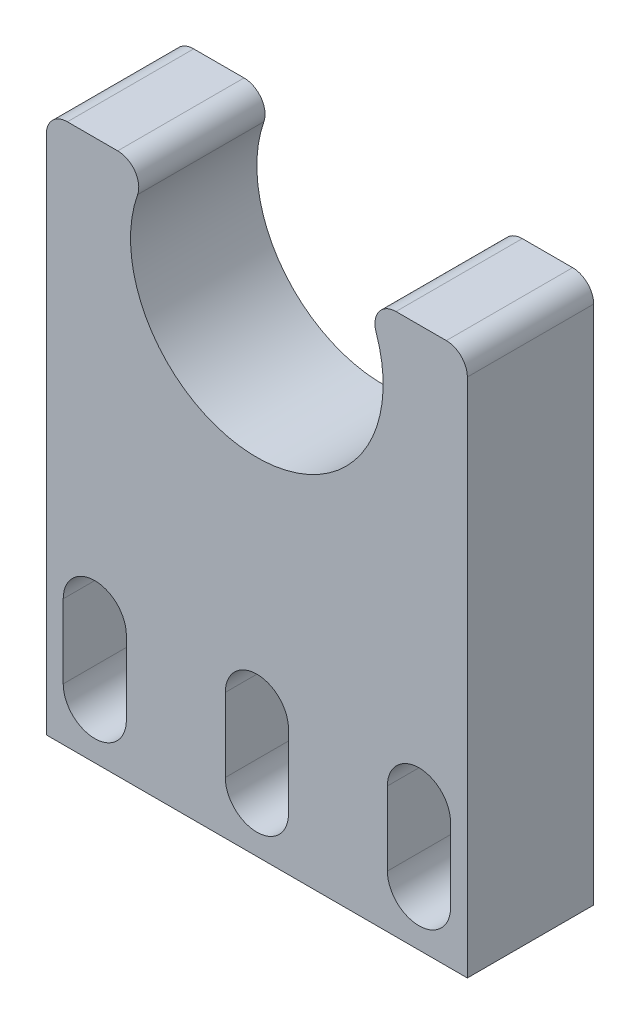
ISO-10303-21;
HEADER;
FILE_DESCRIPTION(('STEP AP214'),'2;1');
FILE_NAME('part.step','',(''),(''),'','','');
FILE_SCHEMA(('AUTOMOTIVE_DESIGN { 1 0 10303 214 1 1 1 1 }'));
ENDSEC;
DATA;
#1=APPLICATION_CONTEXT('core data for automotive mechanical design processes');
#2=APPLICATION_PROTOCOL_DEFINITION('international standard','automotive_design',2000,#1);
#3=PRODUCT_CONTEXT('',#1,'mechanical');
#4=PRODUCT('Part','Part','',(#3));
#5=PRODUCT_RELATED_PRODUCT_CATEGORY('part','',(#4));
#6=PRODUCT_DEFINITION_FORMATION('','',#4);
#7=PRODUCT_DEFINITION_CONTEXT('part definition',#1,'design');
#8=PRODUCT_DEFINITION('design','',#6,#7);
#9=PRODUCT_DEFINITION_SHAPE('','',#8);
#10=(LENGTH_UNIT() NAMED_UNIT(*) SI_UNIT(.MILLI.,.METRE.));
#11=(NAMED_UNIT(*) PLANE_ANGLE_UNIT() SI_UNIT($,.RADIAN.));
#12=(NAMED_UNIT(*) SI_UNIT($,.STERADIAN.) SOLID_ANGLE_UNIT());
#13=UNCERTAINTY_MEASURE_WITH_UNIT(LENGTH_MEASURE(1.E-05),#10,'distance_accuracy_value','');
#14=(GEOMETRIC_REPRESENTATION_CONTEXT(3) GLOBAL_UNCERTAINTY_ASSIGNED_CONTEXT((#13)) GLOBAL_UNIT_ASSIGNED_CONTEXT((#10,
#11,#12)) REPRESENTATION_CONTEXT('',''));
#15=CARTESIAN_POINT('',(0.,0.,0.));
#16=DIRECTION('',(0.,0.,1.));
#17=DIRECTION('',(1.,0.,0.));
#18=AXIS2_PLACEMENT_3D('',#15,#16,#17);
#19=CARTESIAN_POINT('',(-218.342156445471,37.4206206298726,6.));
#20=DIRECTION('',(0.,0.,1.));
#21=DIRECTION('',(1.,0.,0.));
#22=AXIS2_PLACEMENT_3D('',#19,#20,#21);
#23=PLANE('',#22);
#24=DIRECTION('',(0.,-1.,0.));
#25=VECTOR('',#24,1.);
#26=CARTESIAN_POINT('',(-228.840096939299,18.6985803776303,6.));
#27=LINE('',#26,#25);
#28=CARTESIAN_POINT('',(-228.840096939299,18.6985803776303,6.));
#29=VERTEX_POINT('',#28);
#30=CARTESIAN_POINT('',(-228.840096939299,15.1985803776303,6.));
#31=VERTEX_POINT('',#30);
#32=EDGE_CURVE('E217',#29,#31,#27,.T.);
#33=ORIENTED_EDGE('',*,*,#32,.F.);
#34=CARTESIAN_POINT('',(-227.340096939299,18.6985803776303,6.));
#35=DIRECTION('',(0.,0.,1.));
#36=DIRECTION('',(1.,0.,0.));
#37=AXIS2_PLACEMENT_3D('',#34,#35,#36);
#38=CIRCLE('',#37,1.5);
#39=CARTESIAN_POINT('',(-225.840096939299,18.6985803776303,6.));
#40=VERTEX_POINT('',#39);
#41=EDGE_CURVE('E215',#40,#29,#38,.T.);
#42=ORIENTED_EDGE('',*,*,#41,.F.);
#43=DIRECTION('',(0.,1.,0.));
#44=VECTOR('',#43,1.);
#45=CARTESIAN_POINT('',(-225.840096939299,18.6985803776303,6.));
#46=LINE('',#45,#44);
#47=CARTESIAN_POINT('',(-225.840096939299,15.1985803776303,6.));
#48=VERTEX_POINT('',#47);
#49=EDGE_CURVE('E223',#48,#40,#46,.T.);
#50=ORIENTED_EDGE('',*,*,#49,.F.);
#51=CARTESIAN_POINT('',(-227.340096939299,15.1985803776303,6.));
#52=DIRECTION('',(0.,0.,1.));
#53=DIRECTION('',(1.,0.,0.));
#54=AXIS2_PLACEMENT_3D('',#51,#52,#53);
#55=CIRCLE('',#54,1.5);
#56=EDGE_CURVE('E220',#31,#48,#55,.T.);
#57=ORIENTED_EDGE('',*,*,#56,.F.);
#58=EDGE_LOOP('',(#33,#42,#50,#57));
#59=FACE_BOUND('',#58,.T.);
#60=DIRECTION('',(1.,0.,0.));
#61=VECTOR('',#60,1.);
#62=CARTESIAN_POINT('',(-237.342156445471,12.6985803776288,6.));
#63=LINE('',#62,#61);
#64=CARTESIAN_POINT('',(-237.342156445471,12.6985803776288,6.));
#65=VERTEX_POINT('',#64);
#66=CARTESIAN_POINT('',(-217.342156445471,12.6985803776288,6.));
#67=VERTEX_POINT('',#66);
#68=EDGE_CURVE('E277',#65,#67,#63,.T.);
#69=ORIENTED_EDGE('',*,*,#68,.T.);
#70=DIRECTION('',(0.,1.,0.));
#71=VECTOR('',#70,1.);
#72=CARTESIAN_POINT('',(-217.342156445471,12.6985803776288,6.));
#73=LINE('',#72,#71);
#74=CARTESIAN_POINT('',(-217.342156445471,37.4206206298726,6.));
#75=VERTEX_POINT('',#74);
#76=EDGE_CURVE('E279',#67,#75,#73,.T.);
#77=ORIENTED_EDGE('',*,*,#76,.T.);
#78=CARTESIAN_POINT('',(-218.342156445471,37.4206206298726,6.));
#79=DIRECTION('',(0.,0.,1.));
#80=DIRECTION('',(1.,0.,0.));
#81=AXIS2_PLACEMENT_3D('',#78,#79,#80);
#82=CIRCLE('',#81,1.);
#83=CARTESIAN_POINT('',(-218.342156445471,38.4206206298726,6.));
#84=VERTEX_POINT('',#83);
#85=EDGE_CURVE('E282',#75,#84,#82,.T.);
#86=ORIENTED_EDGE('',*,*,#85,.T.);
#87=DIRECTION('',(-1.,0.,0.));
#88=VECTOR('',#87,1.);
#89=CARTESIAN_POINT('',(-220.733106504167,38.4206206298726,6.));
#90=LINE('',#89,#88);
#91=CARTESIAN_POINT('',(-220.733106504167,38.4206206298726,6.));
#92=VERTEX_POINT('',#91);
#93=EDGE_CURVE('E284',#84,#92,#90,.T.);
#94=ORIENTED_EDGE('',*,*,#93,.T.);
#95=CARTESIAN_POINT('',(-220.733106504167,37.4206206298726,6.));
#96=DIRECTION('',(0.,0.,1.));
#97=DIRECTION('',(1.,0.,0.));
#98=AXIS2_PLACEMENT_3D('',#95,#96,#97);
#99=CIRCLE('',#98,0.999999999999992);
#100=CARTESIAN_POINT('',(-221.677256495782,37.0911046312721,6.));
#101=VERTEX_POINT('',#100);
#102=EDGE_CURVE('E286',#92,#101,#99,.T.);
#103=ORIENTED_EDGE('',*,*,#102,.T.);
#104=CARTESIAN_POINT('',(-227.342156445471,35.114008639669,6.));
#105=DIRECTION('',(0.,0.,-1.));
#106=DIRECTION('',(1.,0.,0.));
#107=AXIS2_PLACEMENT_3D('',#104,#105,#106);
#108=CIRCLE('',#107,6.00000000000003);
#109=CARTESIAN_POINT('',(-233.00705639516,37.0911046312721,6.));
#110=VERTEX_POINT('',#109);
#111=EDGE_CURVE('E288',#101,#110,#108,.T.);
#112=ORIENTED_EDGE('',*,*,#111,.T.);
#113=CARTESIAN_POINT('',(-233.951206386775,37.4206206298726,6.));
#114=DIRECTION('',(0.,0.,1.));
#115=DIRECTION('',(1.,0.,0.));
#116=AXIS2_PLACEMENT_3D('',#113,#114,#115);
#117=CIRCLE('',#116,0.999999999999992);
#118=CARTESIAN_POINT('',(-233.951206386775,38.4206206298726,6.));
#119=VERTEX_POINT('',#118);
#120=EDGE_CURVE('E290',#110,#119,#117,.T.);
#121=ORIENTED_EDGE('',*,*,#120,.T.);
#122=DIRECTION('',(-1.,0.,0.));
#123=VECTOR('',#122,1.);
#124=CARTESIAN_POINT('',(-233.951206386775,38.4206206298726,6.));
#125=LINE('',#124,#123);
#126=CARTESIAN_POINT('',(-236.342156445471,38.4206206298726,6.));
#127=VERTEX_POINT('',#126);
#128=EDGE_CURVE('E292',#119,#127,#125,.T.);
#129=ORIENTED_EDGE('',*,*,#128,.T.);
#130=CARTESIAN_POINT('',(-236.342156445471,37.4206206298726,6.));
#131=DIRECTION('',(0.,0.,1.));
#132=DIRECTION('',(-1.,0.,0.));
#133=AXIS2_PLACEMENT_3D('',#130,#131,#132);
#134=CIRCLE('',#133,1.);
#135=CARTESIAN_POINT('',(-237.342156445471,37.4206206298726,6.));
#136=VERTEX_POINT('',#135);
#137=EDGE_CURVE('E294',#127,#136,#134,.T.);
#138=ORIENTED_EDGE('',*,*,#137,.T.);
#139=DIRECTION('',(0.,-1.,0.));
#140=VECTOR('',#139,1.);
#141=CARTESIAN_POINT('',(-237.342156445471,37.4206206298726,6.));
#142=LINE('',#141,#140);
#143=EDGE_CURVE('E296',#136,#65,#142,.T.);
#144=ORIENTED_EDGE('',*,*,#143,.T.);
#145=EDGE_LOOP('',(#69,#77,#86,#94,#103,#112,#121,#129,#138,#144));
#146=FACE_BOUND('',#145,.T.);
#147=DIRECTION('',(0.,-1.,0.));
#148=VECTOR('',#147,1.);
#149=CARTESIAN_POINT('',(-236.540096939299,18.6985803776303,6.));
#150=LINE('',#149,#148);
#151=CARTESIAN_POINT('',(-236.540096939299,18.6985803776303,6.));
#152=VERTEX_POINT('',#151);
#153=CARTESIAN_POINT('',(-236.540096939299,15.1985803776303,6.));
#154=VERTEX_POINT('',#153);
#155=EDGE_CURVE('E248',#152,#154,#150,.T.);
#156=ORIENTED_EDGE('',*,*,#155,.F.);
#157=CARTESIAN_POINT('',(-235.040096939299,18.6985803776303,6.));
#158=DIRECTION('',(0.,0.,1.));
#159=DIRECTION('',(1.,0.,0.));
#160=AXIS2_PLACEMENT_3D('',#157,#158,#159);
#161=CIRCLE('',#160,1.5);
#162=CARTESIAN_POINT('',(-233.540096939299,18.6985803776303,6.));
#163=VERTEX_POINT('',#162);
#164=EDGE_CURVE('E246',#163,#152,#161,.T.);
#165=ORIENTED_EDGE('',*,*,#164,.F.);
#166=DIRECTION('',(0.,1.,0.));
#167=VECTOR('',#166,1.);
#168=CARTESIAN_POINT('',(-233.540096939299,18.6985803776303,6.));
#169=LINE('',#168,#167);
#170=CARTESIAN_POINT('',(-233.540096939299,15.1985803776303,6.));
#171=VERTEX_POINT('',#170);
#172=EDGE_CURVE('E254',#171,#163,#169,.T.);
#173=ORIENTED_EDGE('',*,*,#172,.F.);
#174=CARTESIAN_POINT('',(-235.040096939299,15.1985803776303,6.));
#175=DIRECTION('',(0.,0.,1.));
#176=DIRECTION('',(1.,0.,0.));
#177=AXIS2_PLACEMENT_3D('',#174,#175,#176);
#178=CIRCLE('',#177,1.5);
#179=EDGE_CURVE('E251',#154,#171,#178,.T.);
#180=ORIENTED_EDGE('',*,*,#179,.F.);
#181=EDGE_LOOP('',(#156,#165,#173,#180));
#182=FACE_BOUND('',#181,.T.);
#183=DIRECTION('',(0.,-1.,0.));
#184=VECTOR('',#183,1.);
#185=CARTESIAN_POINT('',(-221.140096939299,18.6985803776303,6.));
#186=LINE('',#185,#184);
#187=CARTESIAN_POINT('',(-221.140096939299,18.6985803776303,6.));
#188=VERTEX_POINT('',#187);
#189=CARTESIAN_POINT('',(-221.140096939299,15.1985803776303,6.));
#190=VERTEX_POINT('',#189);
#191=EDGE_CURVE('E187',#188,#190,#186,.T.);
#192=ORIENTED_EDGE('',*,*,#191,.F.);
#193=CARTESIAN_POINT('',(-219.640096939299,18.6985803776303,6.));
#194=DIRECTION('',(0.,0.,1.));
#195=DIRECTION('',(1.,0.,0.));
#196=AXIS2_PLACEMENT_3D('',#193,#194,#195);
#197=CIRCLE('',#196,1.5);
#198=CARTESIAN_POINT('',(-218.140096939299,18.6985803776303,6.));
#199=VERTEX_POINT('',#198);
#200=EDGE_CURVE('E179',#199,#188,#197,.T.);
#201=ORIENTED_EDGE('',*,*,#200,.F.);
#202=DIRECTION('',(0.,1.,0.));
#203=VECTOR('',#202,1.);
#204=CARTESIAN_POINT('',(-218.140096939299,18.6985803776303,6.));
#205=LINE('',#204,#203);
#206=CARTESIAN_POINT('',(-218.140096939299,15.1985803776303,6.));
#207=VERTEX_POINT('',#206);
#208=EDGE_CURVE('E201',#207,#199,#205,.T.);
#209=ORIENTED_EDGE('',*,*,#208,.F.);
#210=CARTESIAN_POINT('',(-219.640096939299,15.1985803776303,6.));
#211=DIRECTION('',(0.,0.,1.));
#212=DIRECTION('',(1.,0.,0.));
#213=AXIS2_PLACEMENT_3D('',#210,#211,#212);
#214=CIRCLE('',#213,1.5);
#215=EDGE_CURVE('E199',#190,#207,#214,.T.);
#216=ORIENTED_EDGE('',*,*,#215,.F.);
#217=EDGE_LOOP('',(#192,#201,#209,#216));
#218=FACE_BOUND('',#217,.T.);
#219=ADVANCED_FACE('F30',(#59,#146,#182,#218),#23,.T.);
#220=CARTESIAN_POINT('',(-218.342156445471,37.4206206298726,0.));
#221=DIRECTION('',(0.,0.,1.));
#222=DIRECTION('',(1.,0.,0.));
#223=AXIS2_PLACEMENT_3D('',#220,#221,#222);
#224=PLANE('',#223);
#225=CARTESIAN_POINT('',(-227.340096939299,18.6985803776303,0.));
#226=DIRECTION('',(0.,0.,1.));
#227=DIRECTION('',(1.,0.,0.));
#228=AXIS2_PLACEMENT_3D('',#225,#226,#227);
#229=CIRCLE('',#228,1.5);
#230=CARTESIAN_POINT('',(-225.840096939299,18.6985803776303,0.));
#231=VERTEX_POINT('',#230);
#232=CARTESIAN_POINT('',(-228.840096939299,18.6985803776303,0.));
#233=VERTEX_POINT('',#232);
#234=EDGE_CURVE('E195',#231,#233,#229,.T.);
#235=ORIENTED_EDGE('',*,*,#234,.T.);
#236=DIRECTION('',(0.,-1.,0.));
#237=VECTOR('',#236,1.);
#238=CARTESIAN_POINT('',(-228.840096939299,18.6985803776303,0.));
#239=LINE('',#238,#237);
#240=CARTESIAN_POINT('',(-228.840096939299,15.1985803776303,0.));
#241=VERTEX_POINT('',#240);
#242=EDGE_CURVE('E228',#233,#241,#239,.T.);
#243=ORIENTED_EDGE('',*,*,#242,.T.);
#244=CARTESIAN_POINT('',(-227.340096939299,15.1985803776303,0.));
#245=DIRECTION('',(0.,0.,1.));
#246=DIRECTION('',(1.,0.,0.));
#247=AXIS2_PLACEMENT_3D('',#244,#245,#246);
#248=CIRCLE('',#247,1.5);
#249=CARTESIAN_POINT('',(-225.840096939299,15.1985803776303,0.));
#250=VERTEX_POINT('',#249);
#251=EDGE_CURVE('E231',#241,#250,#248,.T.);
#252=ORIENTED_EDGE('',*,*,#251,.T.);
#253=DIRECTION('',(0.,1.,0.));
#254=VECTOR('',#253,1.);
#255=CARTESIAN_POINT('',(-225.840096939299,18.6985803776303,0.));
#256=LINE('',#255,#254);
#257=EDGE_CURVE('E218',#250,#231,#256,.T.);
#258=ORIENTED_EDGE('',*,*,#257,.T.);
#259=EDGE_LOOP('',(#235,#243,#252,#258));
#260=FACE_BOUND('',#259,.T.);
#261=DIRECTION('',(1.,0.,0.));
#262=VECTOR('',#261,1.);
#263=CARTESIAN_POINT('',(-227.342156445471,12.6985803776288,0.));
#264=LINE('',#263,#262);
#265=CARTESIAN_POINT('',(-237.342156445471,12.6985803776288,0.));
#266=VERTEX_POINT('',#265);
#267=CARTESIAN_POINT('',(-217.342156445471,12.6985803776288,0.));
#268=VERTEX_POINT('',#267);
#269=EDGE_CURVE('E276',#266,#268,#264,.T.);
#270=ORIENTED_EDGE('',*,*,#269,.F.);
#271=DIRECTION('',(0.,-1.,0.));
#272=VECTOR('',#271,1.);
#273=CARTESIAN_POINT('',(-237.342156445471,12.6985803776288,0.));
#274=LINE('',#273,#272);
#275=CARTESIAN_POINT('',(-237.342156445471,37.4206206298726,0.));
#276=VERTEX_POINT('',#275);
#277=EDGE_CURVE('E280',#276,#266,#274,.T.);
#278=ORIENTED_EDGE('',*,*,#277,.F.);
#279=CARTESIAN_POINT('',(-236.342156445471,37.4206206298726,0.));
#280=DIRECTION('',(0.,0.,1.));
#281=DIRECTION('',(-1.,0.,0.));
#282=AXIS2_PLACEMENT_3D('',#279,#280,#281);
#283=CIRCLE('',#282,1.);
#284=CARTESIAN_POINT('',(-236.342156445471,38.4206206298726,0.));
#285=VERTEX_POINT('',#284);
#286=EDGE_CURVE('E315',#285,#276,#283,.T.);
#287=ORIENTED_EDGE('',*,*,#286,.F.);
#288=DIRECTION('',(-1.,0.,0.));
#289=VECTOR('',#288,1.);
#290=CARTESIAN_POINT('',(-233.951206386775,38.4206206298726,0.));
#291=LINE('',#290,#289);
#292=CARTESIAN_POINT('',(-233.951206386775,38.4206206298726,0.));
#293=VERTEX_POINT('',#292);
#294=EDGE_CURVE('E313',#293,#285,#291,.T.);
#295=ORIENTED_EDGE('',*,*,#294,.F.);
#296=CARTESIAN_POINT('',(-233.951206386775,37.4206206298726,0.));
#297=DIRECTION('',(0.,0.,1.));
#298=DIRECTION('',(1.,0.,0.));
#299=AXIS2_PLACEMENT_3D('',#296,#297,#298);
#300=CIRCLE('',#299,0.999999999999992);
#301=CARTESIAN_POINT('',(-233.00705639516,37.0911046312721,0.));
#302=VERTEX_POINT('',#301);
#303=EDGE_CURVE('E311',#302,#293,#300,.T.);
#304=ORIENTED_EDGE('',*,*,#303,.F.);
#305=CARTESIAN_POINT('',(-227.342156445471,35.114008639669,0.));
#306=DIRECTION('',(0.,0.,-1.));
#307=DIRECTION('',(1.,0.,0.));
#308=AXIS2_PLACEMENT_3D('',#305,#306,#307);
#309=CIRCLE('',#308,6.00000000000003);
#310=CARTESIAN_POINT('',(-221.677256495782,37.0911046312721,0.));
#311=VERTEX_POINT('',#310);
#312=EDGE_CURVE('E309',#311,#302,#309,.T.);
#313=ORIENTED_EDGE('',*,*,#312,.F.);
#314=CARTESIAN_POINT('',(-220.733106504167,37.4206206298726,0.));
#315=DIRECTION('',(0.,0.,1.));
#316=DIRECTION('',(1.,0.,0.));
#317=AXIS2_PLACEMENT_3D('',#314,#315,#316);
#318=CIRCLE('',#317,0.999999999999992);
#319=CARTESIAN_POINT('',(-220.733106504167,38.4206206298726,0.));
#320=VERTEX_POINT('',#319);
#321=EDGE_CURVE('E307',#320,#311,#318,.T.);
#322=ORIENTED_EDGE('',*,*,#321,.F.);
#323=DIRECTION('',(-1.,0.,0.));
#324=VECTOR('',#323,1.);
#325=CARTESIAN_POINT('',(-220.733106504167,38.4206206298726,0.));
#326=LINE('',#325,#324);
#327=CARTESIAN_POINT('',(-218.342156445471,38.4206206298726,0.));
#328=VERTEX_POINT('',#327);
#329=EDGE_CURVE('E305',#328,#320,#326,.T.);
#330=ORIENTED_EDGE('',*,*,#329,.F.);
#331=CARTESIAN_POINT('',(-218.342156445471,37.4206206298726,0.));
#332=DIRECTION('',(0.,0.,1.));
#333=DIRECTION('',(1.,0.,0.));
#334=AXIS2_PLACEMENT_3D('',#331,#332,#333);
#335=CIRCLE('',#334,1.);
#336=CARTESIAN_POINT('',(-217.342156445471,37.4206206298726,0.));
#337=VERTEX_POINT('',#336);
#338=EDGE_CURVE('E303',#337,#328,#335,.T.);
#339=ORIENTED_EDGE('',*,*,#338,.F.);
#340=DIRECTION('',(0.,1.,0.));
#341=VECTOR('',#340,1.);
#342=CARTESIAN_POINT('',(-217.342156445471,37.4206206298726,0.));
#343=LINE('',#342,#341);
#344=EDGE_CURVE('E301',#268,#337,#343,.T.);
#345=ORIENTED_EDGE('',*,*,#344,.F.);
#346=EDGE_LOOP('',(#270,#278,#287,#295,#304,#313,#322,#330,#339,#345));
#347=FACE_BOUND('',#346,.T.);
#348=CARTESIAN_POINT('',(-235.040096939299,18.6985803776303,0.));
#349=DIRECTION('',(0.,0.,1.));
#350=DIRECTION('',(1.,0.,0.));
#351=AXIS2_PLACEMENT_3D('',#348,#349,#350);
#352=CIRCLE('',#351,1.5);
#353=CARTESIAN_POINT('',(-233.540096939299,18.6985803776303,0.));
#354=VERTEX_POINT('',#353);
#355=CARTESIAN_POINT('',(-236.540096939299,18.6985803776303,0.));
#356=VERTEX_POINT('',#355);
#357=EDGE_CURVE('E245',#354,#356,#352,.T.);
#358=ORIENTED_EDGE('',*,*,#357,.T.);
#359=DIRECTION('',(0.,-1.,0.));
#360=VECTOR('',#359,1.);
#361=CARTESIAN_POINT('',(-236.540096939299,18.6985803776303,0.));
#362=LINE('',#361,#360);
#363=CARTESIAN_POINT('',(-236.540096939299,15.1985803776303,0.));
#364=VERTEX_POINT('',#363);
#365=EDGE_CURVE('E259',#356,#364,#362,.T.);
#366=ORIENTED_EDGE('',*,*,#365,.T.);
#367=CARTESIAN_POINT('',(-235.040096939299,15.1985803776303,0.));
#368=DIRECTION('',(0.,0.,1.));
#369=DIRECTION('',(1.,0.,0.));
#370=AXIS2_PLACEMENT_3D('',#367,#368,#369);
#371=CIRCLE('',#370,1.5);
#372=CARTESIAN_POINT('',(-233.540096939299,15.1985803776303,0.));
#373=VERTEX_POINT('',#372);
#374=EDGE_CURVE('E262',#364,#373,#371,.T.);
#375=ORIENTED_EDGE('',*,*,#374,.T.);
#376=DIRECTION('',(0.,1.,0.));
#377=VECTOR('',#376,1.);
#378=CARTESIAN_POINT('',(-233.540096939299,18.6985803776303,0.));
#379=LINE('',#378,#377);
#380=EDGE_CURVE('E249',#373,#354,#379,.T.);
#381=ORIENTED_EDGE('',*,*,#380,.T.);
#382=EDGE_LOOP('',(#358,#366,#375,#381));
#383=FACE_BOUND('',#382,.T.);
#384=CARTESIAN_POINT('',(-219.640096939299,18.6985803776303,0.));
#385=DIRECTION('',(0.,0.,1.));
#386=DIRECTION('',(1.,0.,0.));
#387=AXIS2_PLACEMENT_3D('',#384,#385,#386);
#388=CIRCLE('',#387,1.5);
#389=CARTESIAN_POINT('',(-218.140096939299,18.6985803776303,0.));
#390=VERTEX_POINT('',#389);
#391=CARTESIAN_POINT('',(-221.140096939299,18.6985803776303,0.));
#392=VERTEX_POINT('',#391);
#393=EDGE_CURVE('E53',#390,#392,#388,.T.);
#394=ORIENTED_EDGE('',*,*,#393,.T.);
#395=DIRECTION('',(0.,-1.,0.));
#396=VECTOR('',#395,1.);
#397=CARTESIAN_POINT('',(-221.140096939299,18.6985803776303,0.));
#398=LINE('',#397,#396);
#399=CARTESIAN_POINT('',(-221.140096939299,15.1985803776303,0.));
#400=VERTEX_POINT('',#399);
#401=EDGE_CURVE('E194',#392,#400,#398,.T.);
#402=ORIENTED_EDGE('',*,*,#401,.T.);
#403=CARTESIAN_POINT('',(-219.640096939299,15.1985803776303,0.));
#404=DIRECTION('',(0.,0.,1.));
#405=DIRECTION('',(1.,0.,0.));
#406=AXIS2_PLACEMENT_3D('',#403,#404,#405);
#407=CIRCLE('',#406,1.5);
#408=CARTESIAN_POINT('',(-218.140096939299,15.1985803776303,0.));
#409=VERTEX_POINT('',#408);
#410=EDGE_CURVE('E207',#400,#409,#407,.T.);
#411=ORIENTED_EDGE('',*,*,#410,.T.);
#412=DIRECTION('',(0.,1.,0.));
#413=VECTOR('',#412,1.);
#414=CARTESIAN_POINT('',(-218.140096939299,18.6985803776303,0.));
#415=LINE('',#414,#413);
#416=EDGE_CURVE('E188',#409,#390,#415,.T.);
#417=ORIENTED_EDGE('',*,*,#416,.T.);
#418=EDGE_LOOP('',(#394,#402,#411,#417));
#419=FACE_BOUND('',#418,.T.);
#420=ADVANCED_FACE('F353',(#260,#347,#383,#419),#224,.F.);
#421=CARTESIAN_POINT('',(-227.342156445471,12.6985803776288,6.));
#422=DIRECTION('',(0.,1.,0.));
#423=DIRECTION('',(-1.,0.,0.));
#424=AXIS2_PLACEMENT_3D('',#421,#422,#423);
#425=PLANE('',#424);
#426=ORIENTED_EDGE('',*,*,#269,.T.);
#427=DIRECTION('',(0.,0.,-1.));
#428=VECTOR('',#427,1.);
#429=CARTESIAN_POINT('',(-217.342156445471,12.6985803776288,6.));
#430=LINE('',#429,#428);
#431=EDGE_CURVE('E11',#67,#268,#430,.T.);
#432=ORIENTED_EDGE('',*,*,#431,.F.);
#433=ORIENTED_EDGE('',*,*,#68,.F.);
#434=DIRECTION('',(0.,0.,-1.));
#435=VECTOR('',#434,1.);
#436=CARTESIAN_POINT('',(-237.342156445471,12.6985803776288,6.));
#437=LINE('',#436,#435);
#438=EDGE_CURVE('E298',#65,#266,#437,.T.);
#439=ORIENTED_EDGE('',*,*,#438,.T.);
#440=EDGE_LOOP('',(#426,#432,#433,#439));
#441=FACE_BOUND('',#440,.T.);
#442=ADVANCED_FACE('F32',(#441),#425,.F.);
#443=CARTESIAN_POINT('',(-217.342156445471,37.4206206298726,6.));
#444=DIRECTION('',(-1.,0.,0.));
#445=DIRECTION('',(0.,-1.,0.));
#446=AXIS2_PLACEMENT_3D('',#443,#444,#445);
#447=PLANE('',#446);
#448=ORIENTED_EDGE('',*,*,#344,.T.);
#449=DIRECTION('',(0.,0.,-1.));
#450=VECTOR('',#449,1.);
#451=CARTESIAN_POINT('',(-217.342156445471,37.4206206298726,6.));
#452=LINE('',#451,#450);
#453=EDGE_CURVE('E38',#75,#337,#452,.T.);
#454=ORIENTED_EDGE('',*,*,#453,.F.);
#455=ORIENTED_EDGE('',*,*,#76,.F.);
#456=ORIENTED_EDGE('',*,*,#431,.T.);
#457=EDGE_LOOP('',(#448,#454,#455,#456));
#458=FACE_BOUND('',#457,.T.);
#459=ADVANCED_FACE('F371',(#458),#447,.F.);
#460=CARTESIAN_POINT('',(-218.342156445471,37.4206206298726,6.));
#461=DIRECTION('',(0.,0.,-1.));
#462=DIRECTION('',(-1.,0.,0.));
#463=AXIS2_PLACEMENT_3D('',#460,#461,#462);
#464=CYLINDRICAL_SURFACE('',#463,1.);
#465=ORIENTED_EDGE('',*,*,#338,.T.);
#466=DIRECTION('',(0.,0.,-1.));
#467=VECTOR('',#466,1.);
#468=CARTESIAN_POINT('',(-218.342156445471,38.4206206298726,6.));
#469=LINE('',#468,#467);
#470=EDGE_CURVE('E340',#84,#328,#469,.T.);
#471=ORIENTED_EDGE('',*,*,#470,.F.);
#472=ORIENTED_EDGE('',*,*,#85,.F.);
#473=ORIENTED_EDGE('',*,*,#453,.T.);
#474=EDGE_LOOP('',(#465,#471,#472,#473));
#475=FACE_BOUND('',#474,.T.);
#476=ADVANCED_FACE('F347',(#475),#464,.T.);
#477=CARTESIAN_POINT('',(-220.733106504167,38.4206206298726,6.));
#478=DIRECTION('',(0.,-1.,0.));
#479=DIRECTION('',(0.,0.,-1.));
#480=AXIS2_PLACEMENT_3D('',#477,#478,#479);
#481=PLANE('',#480);
#482=ORIENTED_EDGE('',*,*,#329,.T.);
#483=DIRECTION('',(0.,0.,-1.));
#484=VECTOR('',#483,1.);
#485=CARTESIAN_POINT('',(-220.733106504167,38.4206206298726,6.));
#486=LINE('',#485,#484);
#487=EDGE_CURVE('E337',#92,#320,#486,.T.);
#488=ORIENTED_EDGE('',*,*,#487,.F.);
#489=ORIENTED_EDGE('',*,*,#93,.F.);
#490=ORIENTED_EDGE('',*,*,#470,.T.);
#491=EDGE_LOOP('',(#482,#488,#489,#490));
#492=FACE_BOUND('',#491,.T.);
#493=ADVANCED_FACE('F359',(#492),#481,.F.);
#494=CARTESIAN_POINT('',(-220.733106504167,37.4206206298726,6.));
#495=DIRECTION('',(0.,0.,-1.));
#496=DIRECTION('',(-1.,0.,0.));
#497=AXIS2_PLACEMENT_3D('',#494,#495,#496);
#498=CYLINDRICAL_SURFACE('',#497,0.999999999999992);
#499=ORIENTED_EDGE('',*,*,#321,.T.);
#500=DIRECTION('',(0.,0.,-1.));
#501=VECTOR('',#500,1.);
#502=CARTESIAN_POINT('',(-221.677256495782,37.0911046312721,6.));
#503=LINE('',#502,#501);
#504=EDGE_CURVE('E334',#101,#311,#503,.T.);
#505=ORIENTED_EDGE('',*,*,#504,.F.);
#506=ORIENTED_EDGE('',*,*,#102,.F.);
#507=ORIENTED_EDGE('',*,*,#487,.T.);
#508=EDGE_LOOP('',(#499,#505,#506,#507));
#509=FACE_BOUND('',#508,.T.);
#510=ADVANCED_FACE('F363',(#509),#498,.T.);
#511=CARTESIAN_POINT('',(-227.342156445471,35.114008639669,6.));
#512=DIRECTION('',(0.,0.,-1.));
#513=DIRECTION('',(-1.,0.,0.));
#514=AXIS2_PLACEMENT_3D('',#511,#512,#513);
#515=CYLINDRICAL_SURFACE('',#514,6.00000000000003);
#516=ORIENTED_EDGE('',*,*,#312,.T.);
#517=DIRECTION('',(0.,0.,-1.));
#518=VECTOR('',#517,1.);
#519=CARTESIAN_POINT('',(-233.00705639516,37.0911046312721,6.));
#520=LINE('',#519,#518);
#521=EDGE_CURVE('E331',#110,#302,#520,.T.);
#522=ORIENTED_EDGE('',*,*,#521,.F.);
#523=ORIENTED_EDGE('',*,*,#111,.F.);
#524=ORIENTED_EDGE('',*,*,#504,.T.);
#525=EDGE_LOOP('',(#516,#522,#523,#524));
#526=FACE_BOUND('',#525,.T.);
#527=ADVANCED_FACE('F393',(#526),#515,.F.);
#528=CARTESIAN_POINT('',(-233.951206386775,37.4206206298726,6.));
#529=DIRECTION('',(0.,0.,-1.));
#530=DIRECTION('',(-1.,0.,0.));
#531=AXIS2_PLACEMENT_3D('',#528,#529,#530);
#532=CYLINDRICAL_SURFACE('',#531,0.999999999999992);
#533=ORIENTED_EDGE('',*,*,#303,.T.);
#534=DIRECTION('',(0.,0.,-1.));
#535=VECTOR('',#534,1.);
#536=CARTESIAN_POINT('',(-233.951206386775,38.4206206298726,6.));
#537=LINE('',#536,#535);
#538=EDGE_CURVE('E328',#119,#293,#537,.T.);
#539=ORIENTED_EDGE('',*,*,#538,.F.);
#540=ORIENTED_EDGE('',*,*,#120,.F.);
#541=ORIENTED_EDGE('',*,*,#521,.T.);
#542=EDGE_LOOP('',(#533,#539,#540,#541));
#543=FACE_BOUND('',#542,.T.);
#544=ADVANCED_FACE('F391',(#543),#532,.T.);
#545=CARTESIAN_POINT('',(-233.951206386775,38.4206206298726,6.));
#546=DIRECTION('',(0.,-1.,0.));
#547=DIRECTION('',(0.,0.,-1.));
#548=AXIS2_PLACEMENT_3D('',#545,#546,#547);
#549=PLANE('',#548);
#550=ORIENTED_EDGE('',*,*,#294,.T.);
#551=DIRECTION('',(0.,0.,-1.));
#552=VECTOR('',#551,1.);
#553=CARTESIAN_POINT('',(-236.342156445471,38.4206206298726,6.));
#554=LINE('',#553,#552);
#555=EDGE_CURVE('E325',#127,#285,#554,.T.);
#556=ORIENTED_EDGE('',*,*,#555,.F.);
#557=ORIENTED_EDGE('',*,*,#128,.F.);
#558=ORIENTED_EDGE('',*,*,#538,.T.);
#559=EDGE_LOOP('',(#550,#556,#557,#558));
#560=FACE_BOUND('',#559,.T.);
#561=ADVANCED_FACE('F386',(#560),#549,.F.);
#562=CARTESIAN_POINT('',(-236.342156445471,37.4206206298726,6.));
#563=DIRECTION('',(0.,0.,-1.));
#564=DIRECTION('',(-1.,0.,0.));
#565=AXIS2_PLACEMENT_3D('',#562,#563,#564);
#566=CYLINDRICAL_SURFACE('',#565,1.);
#567=ORIENTED_EDGE('',*,*,#286,.T.);
#568=DIRECTION('',(0.,0.,-1.));
#569=VECTOR('',#568,1.);
#570=CARTESIAN_POINT('',(-237.342156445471,37.4206206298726,6.));
#571=LINE('',#570,#569);
#572=EDGE_CURVE('E322',#136,#276,#571,.T.);
#573=ORIENTED_EDGE('',*,*,#572,.F.);
#574=ORIENTED_EDGE('',*,*,#137,.F.);
#575=ORIENTED_EDGE('',*,*,#555,.T.);
#576=EDGE_LOOP('',(#567,#573,#574,#575));
#577=FACE_BOUND('',#576,.T.);
#578=ADVANCED_FACE('F381',(#577),#566,.T.);
#579=CARTESIAN_POINT('',(-237.342156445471,12.6985803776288,6.));
#580=DIRECTION('',(1.,0.,0.));
#581=DIRECTION('',(0.,1.,0.));
#582=AXIS2_PLACEMENT_3D('',#579,#580,#581);
#583=PLANE('',#582);
#584=ORIENTED_EDGE('',*,*,#277,.T.);
#585=ORIENTED_EDGE('',*,*,#438,.F.);
#586=ORIENTED_EDGE('',*,*,#143,.F.);
#587=ORIENTED_EDGE('',*,*,#572,.T.);
#588=EDGE_LOOP('',(#584,#585,#586,#587));
#589=FACE_BOUND('',#588,.T.);
#590=ADVANCED_FACE('F376',(#589),#583,.F.);
#591=CARTESIAN_POINT('',(-235.040096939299,18.6985803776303,6.));
#592=DIRECTION('',(0.,0.,-1.));
#593=DIRECTION('',(-1.,0.,0.));
#594=AXIS2_PLACEMENT_3D('',#591,#592,#593);
#595=CYLINDRICAL_SURFACE('',#594,1.5);
#596=ORIENTED_EDGE('',*,*,#357,.F.);
#597=DIRECTION('',(0.,0.,-1.));
#598=VECTOR('',#597,1.);
#599=CARTESIAN_POINT('',(-233.540096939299,18.6985803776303,6.));
#600=LINE('',#599,#598);
#601=EDGE_CURVE('E256',#163,#354,#600,.T.);
#602=ORIENTED_EDGE('',*,*,#601,.F.);
#603=ORIENTED_EDGE('',*,*,#164,.T.);
#604=DIRECTION('',(0.,0.,-1.));
#605=VECTOR('',#604,1.);
#606=CARTESIAN_POINT('',(-236.540096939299,18.6985803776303,6.));
#607=LINE('',#606,#605);
#608=EDGE_CURVE('E273',#152,#356,#607,.T.);
#609=ORIENTED_EDGE('',*,*,#608,.T.);
#610=EDGE_LOOP('',(#596,#602,#603,#609));
#611=FACE_BOUND('',#610,.T.);
#612=ADVANCED_FACE('F412',(#611),#595,.F.);
#613=CARTESIAN_POINT('',(-236.540096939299,18.6985803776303,6.));
#614=DIRECTION('',(1.,0.,0.));
#615=DIRECTION('',(0.,0.,-1.));
#616=AXIS2_PLACEMENT_3D('',#613,#614,#615);
#617=PLANE('',#616);
#618=ORIENTED_EDGE('',*,*,#365,.F.);
#619=ORIENTED_EDGE('',*,*,#608,.F.);
#620=ORIENTED_EDGE('',*,*,#155,.T.);
#621=DIRECTION('',(0.,0.,-1.));
#622=VECTOR('',#621,1.);
#623=CARTESIAN_POINT('',(-236.540096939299,15.1985803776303,6.));
#624=LINE('',#623,#622);
#625=EDGE_CURVE('E271',#154,#364,#624,.T.);
#626=ORIENTED_EDGE('',*,*,#625,.T.);
#627=EDGE_LOOP('',(#618,#619,#620,#626));
#628=FACE_BOUND('',#627,.T.);
#629=ADVANCED_FACE('F438',(#628),#617,.T.);
#630=CARTESIAN_POINT('',(-235.040096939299,15.1985803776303,6.));
#631=DIRECTION('',(0.,0.,-1.));
#632=DIRECTION('',(-1.,0.,0.));
#633=AXIS2_PLACEMENT_3D('',#630,#631,#632);
#634=CYLINDRICAL_SURFACE('',#633,1.5);
#635=ORIENTED_EDGE('',*,*,#374,.F.);
#636=ORIENTED_EDGE('',*,*,#625,.F.);
#637=ORIENTED_EDGE('',*,*,#179,.T.);
#638=DIRECTION('',(0.,0.,-1.));
#639=VECTOR('',#638,1.);
#640=CARTESIAN_POINT('',(-233.540096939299,15.1985803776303,6.));
#641=LINE('',#640,#639);
#642=EDGE_CURVE('E269',#171,#373,#641,.T.);
#643=ORIENTED_EDGE('',*,*,#642,.T.);
#644=EDGE_LOOP('',(#635,#636,#637,#643));
#645=FACE_BOUND('',#644,.T.);
#646=ADVANCED_FACE('F445',(#645),#634,.F.);
#647=CARTESIAN_POINT('',(-233.540096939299,18.6985803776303,6.));
#648=DIRECTION('',(-1.,0.,0.));
#649=DIRECTION('',(0.,0.,1.));
#650=AXIS2_PLACEMENT_3D('',#647,#648,#649);
#651=PLANE('',#650);
#652=ORIENTED_EDGE('',*,*,#380,.F.);
#653=ORIENTED_EDGE('',*,*,#642,.F.);
#654=ORIENTED_EDGE('',*,*,#172,.T.);
#655=ORIENTED_EDGE('',*,*,#601,.T.);
#656=EDGE_LOOP('',(#652,#653,#654,#655));
#657=FACE_BOUND('',#656,.T.);
#658=ADVANCED_FACE('F452',(#657),#651,.T.);
#659=CARTESIAN_POINT('',(-227.340096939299,18.6985803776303,6.));
#660=DIRECTION('',(0.,0.,-1.));
#661=DIRECTION('',(-1.,0.,0.));
#662=AXIS2_PLACEMENT_3D('',#659,#660,#661);
#663=CYLINDRICAL_SURFACE('',#662,1.5);
#664=ORIENTED_EDGE('',*,*,#234,.F.);
#665=DIRECTION('',(0.,0.,-1.));
#666=VECTOR('',#665,1.);
#667=CARTESIAN_POINT('',(-225.840096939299,18.6985803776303,6.));
#668=LINE('',#667,#666);
#669=EDGE_CURVE('E225',#40,#231,#668,.T.);
#670=ORIENTED_EDGE('',*,*,#669,.F.);
#671=ORIENTED_EDGE('',*,*,#41,.T.);
#672=DIRECTION('',(0.,0.,-1.));
#673=VECTOR('',#672,1.);
#674=CARTESIAN_POINT('',(-228.840096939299,18.6985803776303,6.));
#675=LINE('',#674,#673);
#676=EDGE_CURVE('E242',#29,#233,#675,.T.);
#677=ORIENTED_EDGE('',*,*,#676,.T.);
#678=EDGE_LOOP('',(#664,#670,#671,#677));
#679=FACE_BOUND('',#678,.T.);
#680=ADVANCED_FACE('F460',(#679),#663,.F.);
#681=CARTESIAN_POINT('',(-228.840096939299,18.6985803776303,6.));
#682=DIRECTION('',(1.,0.,0.));
#683=DIRECTION('',(0.,0.,-1.));
#684=AXIS2_PLACEMENT_3D('',#681,#682,#683);
#685=PLANE('',#684);
#686=ORIENTED_EDGE('',*,*,#242,.F.);
#687=ORIENTED_EDGE('',*,*,#676,.F.);
#688=ORIENTED_EDGE('',*,*,#32,.T.);
#689=DIRECTION('',(0.,0.,-1.));
#690=VECTOR('',#689,1.);
#691=CARTESIAN_POINT('',(-228.840096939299,15.1985803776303,6.));
#692=LINE('',#691,#690);
#693=EDGE_CURVE('E240',#31,#241,#692,.T.);
#694=ORIENTED_EDGE('',*,*,#693,.T.);
#695=EDGE_LOOP('',(#686,#687,#688,#694));
#696=FACE_BOUND('',#695,.T.);
#697=ADVANCED_FACE('F468',(#696),#685,.T.);
#698=CARTESIAN_POINT('',(-227.340096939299,15.1985803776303,6.));
#699=DIRECTION('',(0.,0.,-1.));
#700=DIRECTION('',(-1.,0.,0.));
#701=AXIS2_PLACEMENT_3D('',#698,#699,#700);
#702=CYLINDRICAL_SURFACE('',#701,1.5);
#703=ORIENTED_EDGE('',*,*,#251,.F.);
#704=ORIENTED_EDGE('',*,*,#693,.F.);
#705=ORIENTED_EDGE('',*,*,#56,.T.);
#706=DIRECTION('',(0.,0.,-1.));
#707=VECTOR('',#706,1.);
#708=CARTESIAN_POINT('',(-225.840096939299,15.1985803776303,6.));
#709=LINE('',#708,#707);
#710=EDGE_CURVE('E238',#48,#250,#709,.T.);
#711=ORIENTED_EDGE('',*,*,#710,.T.);
#712=EDGE_LOOP('',(#703,#704,#705,#711));
#713=FACE_BOUND('',#712,.T.);
#714=ADVANCED_FACE('F476',(#713),#702,.F.);
#715=CARTESIAN_POINT('',(-225.840096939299,18.6985803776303,6.));
#716=DIRECTION('',(-1.,0.,0.));
#717=DIRECTION('',(0.,0.,1.));
#718=AXIS2_PLACEMENT_3D('',#715,#716,#717);
#719=PLANE('',#718);
#720=ORIENTED_EDGE('',*,*,#257,.F.);
#721=ORIENTED_EDGE('',*,*,#710,.F.);
#722=ORIENTED_EDGE('',*,*,#49,.T.);
#723=ORIENTED_EDGE('',*,*,#669,.T.);
#724=EDGE_LOOP('',(#720,#721,#722,#723));
#725=FACE_BOUND('',#724,.T.);
#726=ADVANCED_FACE('F484',(#725),#719,.T.);
#727=CARTESIAN_POINT('',(-219.640096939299,18.6985803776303,6.));
#728=DIRECTION('',(0.,0.,-1.));
#729=DIRECTION('',(-1.,0.,0.));
#730=AXIS2_PLACEMENT_3D('',#727,#728,#729);
#731=CYLINDRICAL_SURFACE('',#730,1.5);
#732=ORIENTED_EDGE('',*,*,#393,.F.);
#733=DIRECTION('',(0.,0.,-1.));
#734=VECTOR('',#733,1.);
#735=CARTESIAN_POINT('',(-218.140096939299,18.6985803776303,6.));
#736=LINE('',#735,#734);
#737=EDGE_CURVE('E183',#199,#390,#736,.T.);
#738=ORIENTED_EDGE('',*,*,#737,.F.);
#739=ORIENTED_EDGE('',*,*,#200,.T.);
#740=DIRECTION('',(0.,0.,-1.));
#741=VECTOR('',#740,1.);
#742=CARTESIAN_POINT('',(-221.140096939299,18.6985803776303,6.));
#743=LINE('',#742,#741);
#744=EDGE_CURVE('E182',#188,#392,#743,.T.);
#745=ORIENTED_EDGE('',*,*,#744,.T.);
#746=EDGE_LOOP('',(#732,#738,#739,#745));
#747=FACE_BOUND('',#746,.T.);
#748=ADVANCED_FACE('F181',(#747),#731,.F.);
#749=CARTESIAN_POINT('',(-221.140096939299,18.6985803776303,6.));
#750=DIRECTION('',(1.,0.,0.));
#751=DIRECTION('',(0.,0.,-1.));
#752=AXIS2_PLACEMENT_3D('',#749,#750,#751);
#753=PLANE('',#752);
#754=ORIENTED_EDGE('',*,*,#401,.F.);
#755=ORIENTED_EDGE('',*,*,#744,.F.);
#756=ORIENTED_EDGE('',*,*,#191,.T.);
#757=DIRECTION('',(0.,0.,-1.));
#758=VECTOR('',#757,1.);
#759=CARTESIAN_POINT('',(-221.140096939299,15.1985803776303,6.));
#760=LINE('',#759,#758);
#761=EDGE_CURVE('E196',#190,#400,#760,.T.);
#762=ORIENTED_EDGE('',*,*,#761,.T.);
#763=EDGE_LOOP('',(#754,#755,#756,#762));
#764=FACE_BOUND('',#763,.T.);
#765=ADVANCED_FACE('F191',(#764),#753,.T.);
#766=CARTESIAN_POINT('',(-219.640096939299,15.1985803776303,6.));
#767=DIRECTION('',(0.,0.,-1.));
#768=DIRECTION('',(-1.,0.,0.));
#769=AXIS2_PLACEMENT_3D('',#766,#767,#768);
#770=CYLINDRICAL_SURFACE('',#769,1.5);
#771=ORIENTED_EDGE('',*,*,#410,.F.);
#772=ORIENTED_EDGE('',*,*,#761,.F.);
#773=ORIENTED_EDGE('',*,*,#215,.T.);
#774=DIRECTION('',(0.,0.,-1.));
#775=VECTOR('',#774,1.);
#776=CARTESIAN_POINT('',(-218.140096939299,15.1985803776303,6.));
#777=LINE('',#776,#775);
#778=EDGE_CURVE('E45',#207,#409,#777,.T.);
#779=ORIENTED_EDGE('',*,*,#778,.T.);
#780=EDGE_LOOP('',(#771,#772,#773,#779));
#781=FACE_BOUND('',#780,.T.);
#782=ADVANCED_FACE('F505',(#781),#770,.F.);
#783=CARTESIAN_POINT('',(-218.140096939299,18.6985803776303,6.));
#784=DIRECTION('',(-1.,0.,0.));
#785=DIRECTION('',(0.,0.,1.));
#786=AXIS2_PLACEMENT_3D('',#783,#784,#785);
#787=PLANE('',#786);
#788=ORIENTED_EDGE('',*,*,#416,.F.);
#789=ORIENTED_EDGE('',*,*,#778,.F.);
#790=ORIENTED_EDGE('',*,*,#208,.T.);
#791=ORIENTED_EDGE('',*,*,#737,.T.);
#792=EDGE_LOOP('',(#788,#789,#790,#791));
#793=FACE_BOUND('',#792,.T.);
#794=ADVANCED_FACE('F512',(#793),#787,.T.);
#795=CLOSED_SHELL('',(#219,#420,#442,#459,#476,#493,#510,#527,#544,#561,#578,#590,#612,#629,
#646,#658,#680,#697,#714,#726,#748,#765,#782,#794));
#796=MANIFOLD_SOLID_BREP('B2',#795);
#797=ADVANCED_BREP_SHAPE_REPRESENTATION('',(#18,#796),#14);
#798=SHAPE_DEFINITION_REPRESENTATION(#9,#797);
ENDSEC;
END-ISO-10303-21;
